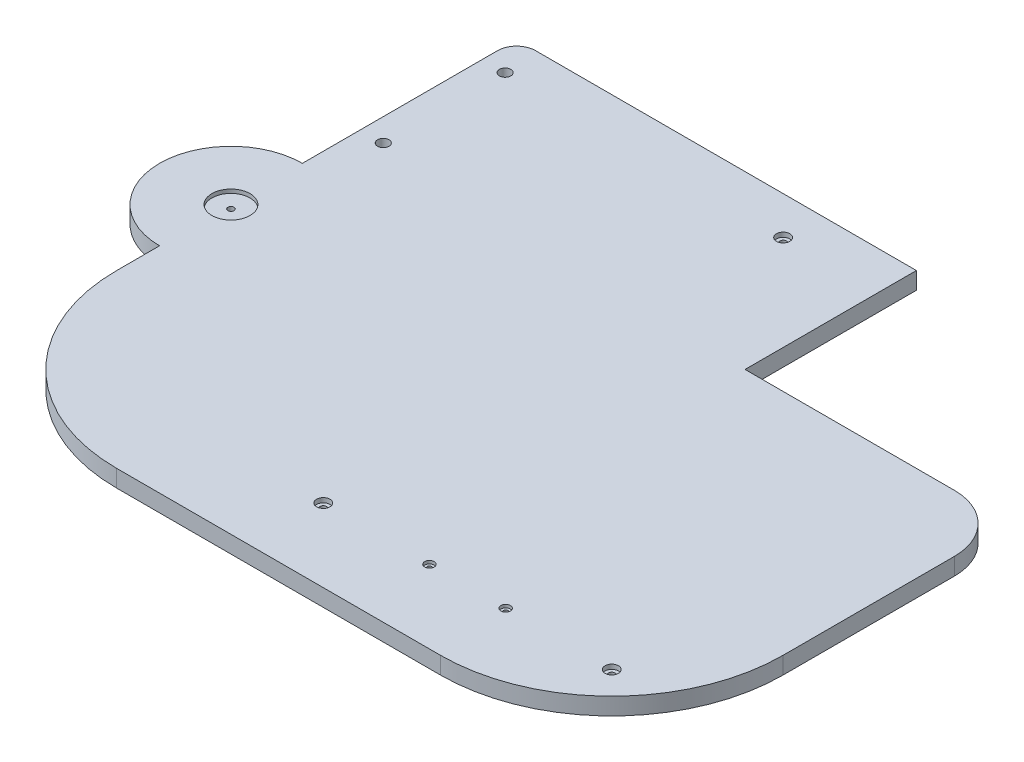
ISO-10303-21;
HEADER;
FILE_DESCRIPTION(('STEP AP214'),'2;1');
FILE_NAME('part.step','',(''),(''),'','','');
FILE_SCHEMA(('AUTOMOTIVE_DESIGN { 1 0 10303 214 1 1 1 1 }'));
ENDSEC;
DATA;
#1=APPLICATION_CONTEXT('core data for automotive mechanical design processes');
#2=APPLICATION_PROTOCOL_DEFINITION('international standard','automotive_design',2000,#1);
#3=PRODUCT_CONTEXT('',#1,'mechanical');
#4=PRODUCT('Part','Part','',(#3));
#5=PRODUCT_RELATED_PRODUCT_CATEGORY('part','',(#4));
#6=PRODUCT_DEFINITION_FORMATION('','',#4);
#7=PRODUCT_DEFINITION_CONTEXT('part definition',#1,'design');
#8=PRODUCT_DEFINITION('design','',#6,#7);
#9=PRODUCT_DEFINITION_SHAPE('','',#8);
#10=(LENGTH_UNIT() NAMED_UNIT(*) SI_UNIT(.MILLI.,.METRE.));
#11=(NAMED_UNIT(*) PLANE_ANGLE_UNIT() SI_UNIT($,.RADIAN.));
#12=(NAMED_UNIT(*) SI_UNIT($,.STERADIAN.) SOLID_ANGLE_UNIT());
#13=UNCERTAINTY_MEASURE_WITH_UNIT(LENGTH_MEASURE(1.E-05),#10,'distance_accuracy_value','');
#14=(GEOMETRIC_REPRESENTATION_CONTEXT(3) GLOBAL_UNCERTAINTY_ASSIGNED_CONTEXT((#13)) GLOBAL_UNIT_ASSIGNED_CONTEXT((#10,
#11,#12)) REPRESENTATION_CONTEXT('',''));
#15=CARTESIAN_POINT('',(0.,0.,0.));
#16=DIRECTION('',(0.,0.,1.));
#17=DIRECTION('',(1.,0.,0.));
#18=AXIS2_PLACEMENT_3D('',#15,#16,#17);
#19=CARTESIAN_POINT('',(37.5000000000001,229.,-1.30930550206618E-13));
#20=DIRECTION('',(0.,-1.,0.));
#21=DIRECTION('',(0.,0.,1.));
#22=AXIS2_PLACEMENT_3D('',#19,#20,#21);
#23=PLANE('',#22);
#24=CARTESIAN_POINT('',(118.250000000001,229.,111.499999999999));
#25=DIRECTION('',(0.,1.,0.));
#26=DIRECTION('',(0.,0.,-1.));
#27=AXIS2_PLACEMENT_3D('',#24,#25,#26);
#28=CIRCLE('',#27,2.5);
#29=CARTESIAN_POINT('',(118.250000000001,229.,108.999999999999));
#30=VERTEX_POINT('',#29);
#31=EDGE_CURVE('E660',#30,#30,#28,.T.);
#32=ORIENTED_EDGE('',*,*,#31,.F.);
#33=EDGE_LOOP('',(#32));
#34=FACE_BOUND('',#33,.T.);
#35=CARTESIAN_POINT('',(-137.5,229.,1.09108791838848E-12));
#36=DIRECTION('',(0.,1.,0.));
#37=DIRECTION('',(0.,0.,-1.));
#38=AXIS2_PLACEMENT_3D('',#35,#36,#37);
#39=CIRCLE('',#38,10.);
#40=CARTESIAN_POINT('',(-137.5,229.,-9.99999999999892));
#41=VERTEX_POINT('',#40);
#42=EDGE_CURVE('E257',#41,#41,#39,.T.);
#43=ORIENTED_EDGE('',*,*,#42,.F.);
#44=EDGE_LOOP('',(#43));
#45=FACE_BOUND('',#44,.T.);
#46=CARTESIAN_POINT('',(174.000000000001,229.,111.499999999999));
#47=DIRECTION('',(0.,1.,0.));
#48=DIRECTION('',(0.,0.,-1.));
#49=AXIS2_PLACEMENT_3D('',#46,#47,#48);
#50=CIRCLE('',#49,3.5);
#51=CARTESIAN_POINT('',(174.000000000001,229.,107.999999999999));
#52=VERTEX_POINT('',#51);
#53=EDGE_CURVE('E261',#52,#52,#50,.T.);
#54=ORIENTED_EDGE('',*,*,#53,.F.);
#55=EDGE_LOOP('',(#54));
#56=FACE_BOUND('',#55,.T.);
#57=CARTESIAN_POINT('',(22.5000000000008,229.,111.5));
#58=DIRECTION('',(0.,1.,0.));
#59=DIRECTION('',(0.,0.,-1.));
#60=AXIS2_PLACEMENT_3D('',#57,#58,#59);
#61=CIRCLE('',#60,3.5);
#62=CARTESIAN_POINT('',(22.5000000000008,229.,108.));
#63=VERTEX_POINT('',#62);
#64=EDGE_CURVE('E235',#63,#63,#61,.T.);
#65=ORIENTED_EDGE('',*,*,#64,.F.);
#66=EDGE_LOOP('',(#65));
#67=FACE_BOUND('',#66,.T.);
#68=CARTESIAN_POINT('',(22.4999999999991,229.,-130.));
#69=DIRECTION('',(0.,1.,0.));
#70=DIRECTION('',(0.,0.,-1.));
#71=AXIS2_PLACEMENT_3D('',#68,#69,#70);
#72=CIRCLE('',#71,3.5);
#73=CARTESIAN_POINT('',(22.4999999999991,229.,-133.5));
#74=VERTEX_POINT('',#73);
#75=EDGE_CURVE('E230',#74,#74,#72,.T.);
#76=ORIENTED_EDGE('',*,*,#75,.F.);
#77=EDGE_LOOP('',(#76));
#78=FACE_BOUND('',#77,.T.);
#79=CARTESIAN_POINT('',(-125.5,229.,-68.0000000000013));
#80=DIRECTION('',(0.,-1.,0.));
#81=DIRECTION('',(0.,0.,1.));
#82=AXIS2_PLACEMENT_3D('',#79,#80,#81);
#83=CIRCLE('',#82,2.99999999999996);
#84=CARTESIAN_POINT('',(-125.5,229.,-65.0000000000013));
#85=VERTEX_POINT('',#84);
#86=EDGE_CURVE('E156',#85,#85,#83,.T.);
#87=ORIENTED_EDGE('',*,*,#86,.T.);
#88=EDGE_LOOP('',(#87));
#89=FACE_BOUND('',#88,.T.);
#90=CARTESIAN_POINT('',(-125.500000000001,229.,-132.000000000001));
#91=DIRECTION('',(0.,-1.,0.));
#92=DIRECTION('',(0.,0.,1.));
#93=AXIS2_PLACEMENT_3D('',#90,#91,#92);
#94=CIRCLE('',#93,2.99999999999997);
#95=CARTESIAN_POINT('',(-125.500000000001,229.,-129.000000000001));
#96=VERTEX_POINT('',#95);
#97=EDGE_CURVE('E163',#96,#96,#94,.T.);
#98=ORIENTED_EDGE('',*,*,#97,.T.);
#99=EDGE_LOOP('',(#98));
#100=FACE_BOUND('',#99,.T.);
#101=DIRECTION('',(0.,0.,-1.));
#102=VECTOR('',#101,1.);
#103=CARTESIAN_POINT('',(212.5,229.,-1.35294901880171E-12));
#104=LINE('',#103,#102);
#105=CARTESIAN_POINT('',(212.5,229.,59.9999999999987));
#106=VERTEX_POINT('',#105);
#107=CARTESIAN_POINT('',(212.5,229.,-30.0000000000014));
#108=VERTEX_POINT('',#107);
#109=EDGE_CURVE('E174',#106,#108,#104,.T.);
#110=ORIENTED_EDGE('',*,*,#109,.T.);
#111=CARTESIAN_POINT('',(182.5,229.,-30.0000000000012));
#112=DIRECTION('',(0.,-1.,0.));
#113=DIRECTION('',(0.,0.,1.));
#114=AXIS2_PLACEMENT_3D('',#111,#112,#113);
#115=CIRCLE('',#114,30.);
#116=CARTESIAN_POINT('',(182.5,229.,-60.0000000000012));
#117=VERTEX_POINT('',#116);
#118=EDGE_CURVE('E56',#108,#117,#115,.F.);
#119=ORIENTED_EDGE('',*,*,#118,.T.);
#120=DIRECTION('',(1.,0.,0.));
#121=VECTOR('',#120,1.);
#122=CARTESIAN_POINT('',(172.5,229.,-60.0000000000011));
#123=LINE('',#122,#121);
#124=CARTESIAN_POINT('',(72.4999999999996,229.,-60.0000000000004));
#125=VERTEX_POINT('',#124);
#126=EDGE_CURVE('E123',#125,#117,#123,.T.);
#127=ORIENTED_EDGE('',*,*,#126,.F.);
#128=DIRECTION('',(0.,0.,1.));
#129=VECTOR('',#128,1.);
#130=CARTESIAN_POINT('',(72.4999999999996,229.,-60.0000000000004));
#131=LINE('',#130,#129);
#132=CARTESIAN_POINT('',(72.4999999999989,229.,-150.));
#133=VERTEX_POINT('',#132);
#134=EDGE_CURVE('E131',#133,#125,#131,.T.);
#135=ORIENTED_EDGE('',*,*,#134,.F.);
#136=DIRECTION('',(-1.,0.,0.));
#137=VECTOR('',#136,1.);
#138=CARTESIAN_POINT('',(212.499999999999,229.,-150.000000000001));
#139=LINE('',#138,#137);
#140=CARTESIAN_POINT('',(-127.500000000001,229.,-149.999999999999));
#141=VERTEX_POINT('',#140);
#142=EDGE_CURVE('E175',#133,#141,#139,.T.);
#143=ORIENTED_EDGE('',*,*,#142,.T.);
#144=CARTESIAN_POINT('',(-127.500000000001,229.,-139.999999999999));
#145=DIRECTION('',(0.,-1.,0.));
#146=DIRECTION('',(0.,0.,1.));
#147=AXIS2_PLACEMENT_3D('',#144,#145,#146);
#148=CIRCLE('',#147,10.);
#149=CARTESIAN_POINT('',(-137.500000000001,229.,-139.999999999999));
#150=VERTEX_POINT('',#149);
#151=EDGE_CURVE('E203',#141,#150,#148,.F.);
#152=ORIENTED_EDGE('',*,*,#151,.T.);
#153=DIRECTION('',(0.,0.,1.));
#154=VECTOR('',#153,1.);
#155=CARTESIAN_POINT('',(-137.500000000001,229.,-149.999999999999));
#156=LINE('',#155,#154);
#157=CARTESIAN_POINT('',(-137.5,229.,-37.4999999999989));
#158=VERTEX_POINT('',#157);
#159=EDGE_CURVE('E168',#150,#158,#156,.T.);
#160=ORIENTED_EDGE('',*,*,#159,.T.);
#161=CARTESIAN_POINT('',(-137.5,229.,1.09108791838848E-12));
#162=DIRECTION('',(0.,1.,0.));
#163=DIRECTION('',(0.,0.,-1.));
#164=AXIS2_PLACEMENT_3D('',#161,#162,#163);
#165=CIRCLE('',#164,37.5);
#166=CARTESIAN_POINT('',(-137.5,229.,37.5000000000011));
#167=VERTEX_POINT('',#166);
#168=EDGE_CURVE('E127',#158,#167,#165,.T.);
#169=ORIENTED_EDGE('',*,*,#168,.T.);
#170=CARTESIAN_POINT('',(-137.5,229.,60.0000000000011));
#171=VERTEX_POINT('',#170);
#172=EDGE_CURVE('E171',#167,#171,#156,.T.);
#173=ORIENTED_EDGE('',*,*,#172,.T.);
#174=CARTESIAN_POINT('',(-47.4999999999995,229.,60.0000000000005));
#175=DIRECTION('',(0.,-1.,0.));
#176=DIRECTION('',(0.,0.,1.));
#177=AXIS2_PLACEMENT_3D('',#174,#175,#176);
#178=CIRCLE('',#177,90.);
#179=CARTESIAN_POINT('',(-47.4999999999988,229.,150.));
#180=VERTEX_POINT('',#179);
#181=EDGE_CURVE('E192',#171,#180,#178,.F.);
#182=ORIENTED_EDGE('',*,*,#181,.T.);
#183=DIRECTION('',(1.,0.,0.));
#184=VECTOR('',#183,1.);
#185=CARTESIAN_POINT('',(212.500000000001,229.,149.999999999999));
#186=LINE('',#185,#184);
#187=CARTESIAN_POINT('',(122.500000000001,229.,149.999999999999));
#188=VERTEX_POINT('',#187);
#189=EDGE_CURVE('E170',#180,#188,#186,.T.);
#190=ORIENTED_EDGE('',*,*,#189,.T.);
#191=CARTESIAN_POINT('',(122.5,229.,59.9999999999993));
#192=DIRECTION('',(0.,-1.,0.));
#193=DIRECTION('',(0.,0.,1.));
#194=AXIS2_PLACEMENT_3D('',#191,#192,#193);
#195=CIRCLE('',#194,90.);
#196=EDGE_CURVE('E218',#188,#106,#195,.F.);
#197=ORIENTED_EDGE('',*,*,#196,.T.);
#198=EDGE_LOOP('',(#110,#119,#127,#135,#143,#152,#160,#169,#173,#182,#190,#197));
#199=FACE_BOUND('',#198,.T.);
#200=CARTESIAN_POINT('',(78.2500000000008,229.,111.5));
#201=DIRECTION('',(0.,1.,0.));
#202=DIRECTION('',(0.,0.,-1.));
#203=AXIS2_PLACEMENT_3D('',#200,#201,#202);
#204=CIRCLE('',#203,2.5);
#205=CARTESIAN_POINT('',(78.2500000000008,229.,109.));
#206=VERTEX_POINT('',#205);
#207=EDGE_CURVE('E251',#206,#206,#204,.T.);
#208=ORIENTED_EDGE('',*,*,#207,.F.);
#209=EDGE_LOOP('',(#208));
#210=FACE_BOUND('',#209,.T.);
#211=ADVANCED_FACE('F32',(#34,#45,#56,#67,#78,#89,#100,#199,#210),#23,.F.);
#212=CARTESIAN_POINT('',(212.499999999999,229.,-150.000000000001));
#213=DIRECTION('',(0.,0.,1.));
#214=DIRECTION('',(1.,0.,0.));
#215=AXIS2_PLACEMENT_3D('',#212,#213,#214);
#216=PLANE('',#215);
#217=ORIENTED_EDGE('',*,*,#142,.F.);
#218=DIRECTION('',(0.,1.,0.));
#219=VECTOR('',#218,1.);
#220=CARTESIAN_POINT('',(72.4999999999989,-125.536240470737,-150.));
#221=LINE('',#220,#219);
#222=CARTESIAN_POINT('',(72.4999999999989,220.,-150.));
#223=VERTEX_POINT('',#222);
#224=EDGE_CURVE('E128',#223,#133,#221,.T.);
#225=ORIENTED_EDGE('',*,*,#224,.F.);
#226=DIRECTION('',(-1.,0.,0.));
#227=VECTOR('',#226,1.);
#228=CARTESIAN_POINT('',(212.499999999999,220.,-150.000000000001));
#229=LINE('',#228,#227);
#230=CARTESIAN_POINT('',(-127.500000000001,220.,-149.999999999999));
#231=VERTEX_POINT('',#230);
#232=EDGE_CURVE('E184',#223,#231,#229,.T.);
#233=ORIENTED_EDGE('',*,*,#232,.T.);
#234=DIRECTION('',(0.,-1.,0.));
#235=VECTOR('',#234,1.);
#236=CARTESIAN_POINT('',(-127.500000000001,229.,-149.999999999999));
#237=LINE('',#236,#235);
#238=EDGE_CURVE('E200',#231,#141,#237,.F.);
#239=ORIENTED_EDGE('',*,*,#238,.T.);
#240=EDGE_LOOP('',(#217,#225,#233,#239));
#241=FACE_BOUND('',#240,.T.);
#242=ADVANCED_FACE('F302',(#241),#216,.F.);
#243=CARTESIAN_POINT('',(-137.500000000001,229.,-149.999999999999));
#244=DIRECTION('',(1.,0.,0.));
#245=DIRECTION('',(0.,0.,-1.));
#246=AXIS2_PLACEMENT_3D('',#243,#244,#245);
#247=PLANE('',#246);
#248=ORIENTED_EDGE('',*,*,#159,.F.);
#249=DIRECTION('',(0.,-1.,0.));
#250=VECTOR('',#249,1.);
#251=CARTESIAN_POINT('',(-137.500000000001,229.,-139.999999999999));
#252=LINE('',#251,#250);
#253=CARTESIAN_POINT('',(-137.500000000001,220.,-139.999999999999));
#254=VERTEX_POINT('',#253);
#255=EDGE_CURVE('E194',#150,#254,#252,.T.);
#256=ORIENTED_EDGE('',*,*,#255,.T.);
#257=DIRECTION('',(0.,0.,1.));
#258=VECTOR('',#257,1.);
#259=CARTESIAN_POINT('',(-137.500000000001,220.,-149.999999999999));
#260=LINE('',#259,#258);
#261=CARTESIAN_POINT('',(-137.5,220.,-37.4999999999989));
#262=VERTEX_POINT('',#261);
#263=EDGE_CURVE('E178',#254,#262,#260,.T.);
#264=ORIENTED_EDGE('',*,*,#263,.T.);
#265=DIRECTION('',(0.,1.,0.));
#266=VECTOR('',#265,1.);
#267=CARTESIAN_POINT('',(-137.5,220.,-37.4999999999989));
#268=LINE('',#267,#266);
#269=EDGE_CURVE('E150',#262,#158,#268,.T.);
#270=ORIENTED_EDGE('',*,*,#269,.T.);
#271=EDGE_LOOP('',(#248,#256,#264,#270));
#272=FACE_BOUND('',#271,.T.);
#273=ADVANCED_FACE('F308',(#272),#247,.F.);
#274=CARTESIAN_POINT('',(-137.5,220.,37.5000000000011));
#275=VERTEX_POINT('',#274);
#276=CARTESIAN_POINT('',(-137.5,220.,60.0000000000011));
#277=VERTEX_POINT('',#276);
#278=EDGE_CURVE('E159',#275,#277,#260,.T.);
#279=ORIENTED_EDGE('',*,*,#278,.T.);
#280=DIRECTION('',(0.,-1.,0.));
#281=VECTOR('',#280,1.);
#282=CARTESIAN_POINT('',(-137.5,229.,60.0000000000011));
#283=LINE('',#282,#281);
#284=EDGE_CURVE('E190',#277,#171,#283,.F.);
#285=ORIENTED_EDGE('',*,*,#284,.T.);
#286=ORIENTED_EDGE('',*,*,#172,.F.);
#287=DIRECTION('',(0.,1.,0.));
#288=VECTOR('',#287,1.);
#289=CARTESIAN_POINT('',(-137.5,220.,37.5000000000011));
#290=LINE('',#289,#288);
#291=EDGE_CURVE('E147',#275,#167,#290,.T.);
#292=ORIENTED_EDGE('',*,*,#291,.F.);
#293=EDGE_LOOP('',(#279,#285,#286,#292));
#294=FACE_BOUND('',#293,.T.);
#295=ADVANCED_FACE('F325',(#294),#247,.F.);
#296=CARTESIAN_POINT('',(212.500000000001,229.,149.999999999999));
#297=DIRECTION('',(0.,0.,-1.));
#298=DIRECTION('',(-1.,0.,0.));
#299=AXIS2_PLACEMENT_3D('',#296,#297,#298);
#300=PLANE('',#299);
#301=DIRECTION('',(1.,0.,0.));
#302=VECTOR('',#301,1.);
#303=CARTESIAN_POINT('',(212.500000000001,220.,149.999999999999));
#304=LINE('',#303,#302);
#305=CARTESIAN_POINT('',(-47.4999999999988,220.,150.));
#306=VERTEX_POINT('',#305);
#307=CARTESIAN_POINT('',(122.500000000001,220.,149.999999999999));
#308=VERTEX_POINT('',#307);
#309=EDGE_CURVE('E180',#306,#308,#304,.T.);
#310=ORIENTED_EDGE('',*,*,#309,.T.);
#311=DIRECTION('',(0.,-1.,0.));
#312=VECTOR('',#311,1.);
#313=CARTESIAN_POINT('',(122.500000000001,229.,149.999999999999));
#314=LINE('',#313,#312);
#315=EDGE_CURVE('E216',#308,#188,#314,.F.);
#316=ORIENTED_EDGE('',*,*,#315,.T.);
#317=ORIENTED_EDGE('',*,*,#189,.F.);
#318=DIRECTION('',(0.,-1.,0.));
#319=VECTOR('',#318,1.);
#320=CARTESIAN_POINT('',(-47.4999999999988,229.,150.));
#321=LINE('',#320,#319);
#322=EDGE_CURVE('E177',#180,#306,#321,.T.);
#323=ORIENTED_EDGE('',*,*,#322,.T.);
#324=EDGE_LOOP('',(#310,#316,#317,#323));
#325=FACE_BOUND('',#324,.T.);
#326=ADVANCED_FACE('F322',(#325),#300,.F.);
#327=CARTESIAN_POINT('',(212.499999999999,229.,-150.000000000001));
#328=DIRECTION('',(-1.,0.,0.));
#329=DIRECTION('',(0.,0.,1.));
#330=AXIS2_PLACEMENT_3D('',#327,#328,#329);
#331=PLANE('',#330);
#332=DIRECTION('',(0.,0.,-1.));
#333=VECTOR('',#332,1.);
#334=CARTESIAN_POINT('',(212.5,220.,-1.35294901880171E-12));
#335=LINE('',#334,#333);
#336=CARTESIAN_POINT('',(212.5,220.,59.9999999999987));
#337=VERTEX_POINT('',#336);
#338=CARTESIAN_POINT('',(212.5,220.,-30.0000000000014));
#339=VERTEX_POINT('',#338);
#340=EDGE_CURVE('E183',#337,#339,#335,.T.);
#341=ORIENTED_EDGE('',*,*,#340,.T.);
#342=DIRECTION('',(0.,1.,0.));
#343=VECTOR('',#342,1.);
#344=CARTESIAN_POINT('',(212.5,229.,-30.0000000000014));
#345=LINE('',#344,#343);
#346=EDGE_CURVE('E220',#339,#108,#345,.T.);
#347=ORIENTED_EDGE('',*,*,#346,.T.);
#348=ORIENTED_EDGE('',*,*,#109,.F.);
#349=DIRECTION('',(0.,-1.,0.));
#350=VECTOR('',#349,1.);
#351=CARTESIAN_POINT('',(212.5,229.,59.9999999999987));
#352=LINE('',#351,#350);
#353=EDGE_CURVE('E208',#106,#337,#352,.T.);
#354=ORIENTED_EDGE('',*,*,#353,.T.);
#355=EDGE_LOOP('',(#341,#347,#348,#354));
#356=FACE_BOUND('',#355,.T.);
#357=ADVANCED_FACE('F319',(#356),#331,.F.);
#358=CARTESIAN_POINT('',(37.5000000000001,220.,-1.30930550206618E-13));
#359=DIRECTION('',(0.,-1.,0.));
#360=DIRECTION('',(0.,0.,1.));
#361=AXIS2_PLACEMENT_3D('',#358,#359,#360);
#362=PLANE('',#361);
#363=CARTESIAN_POINT('',(118.250000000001,220.,111.499999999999));
#364=DIRECTION('',(0.,-1.,0.));
#365=DIRECTION('',(0.,0.,1.));
#366=AXIS2_PLACEMENT_3D('',#363,#364,#365);
#367=CIRCLE('',#366,1.19999999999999);
#368=CARTESIAN_POINT('',(118.250000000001,220.,112.699999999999));
#369=VERTEX_POINT('',#368);
#370=EDGE_CURVE('E36',#369,#369,#367,.T.);
#371=ORIENTED_EDGE('',*,*,#370,.F.);
#372=EDGE_LOOP('',(#371));
#373=FACE_BOUND('',#372,.T.);
#374=CARTESIAN_POINT('',(78.2500000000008,220.,111.5));
#375=DIRECTION('',(0.,-1.,0.));
#376=DIRECTION('',(0.,0.,1.));
#377=AXIS2_PLACEMENT_3D('',#374,#375,#376);
#378=CIRCLE('',#377,1.2);
#379=CARTESIAN_POINT('',(78.2500000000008,220.,112.7));
#380=VERTEX_POINT('',#379);
#381=EDGE_CURVE('E240',#380,#380,#378,.T.);
#382=ORIENTED_EDGE('',*,*,#381,.F.);
#383=EDGE_LOOP('',(#382));
#384=FACE_BOUND('',#383,.T.);
#385=CARTESIAN_POINT('',(-137.5,220.,1.09108791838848E-12));
#386=DIRECTION('',(0.,-1.,0.));
#387=DIRECTION('',(0.,0.,1.));
#388=AXIS2_PLACEMENT_3D('',#385,#386,#387);
#389=CIRCLE('',#388,1.59999999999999);
#390=CARTESIAN_POINT('',(-137.5,220.,1.60000000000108));
#391=VERTEX_POINT('',#390);
#392=EDGE_CURVE('E237',#391,#391,#389,.T.);
#393=ORIENTED_EDGE('',*,*,#392,.F.);
#394=EDGE_LOOP('',(#393));
#395=FACE_BOUND('',#394,.T.);
#396=CARTESIAN_POINT('',(174.000000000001,220.,111.499999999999));
#397=DIRECTION('',(0.,-1.,0.));
#398=DIRECTION('',(0.,0.,1.));
#399=AXIS2_PLACEMENT_3D('',#396,#397,#398);
#400=CIRCLE('',#399,1.70000000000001);
#401=CARTESIAN_POINT('',(174.000000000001,220.,113.199999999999));
#402=VERTEX_POINT('',#401);
#403=EDGE_CURVE('E232',#402,#402,#400,.T.);
#404=ORIENTED_EDGE('',*,*,#403,.F.);
#405=EDGE_LOOP('',(#404));
#406=FACE_BOUND('',#405,.T.);
#407=CARTESIAN_POINT('',(22.5000000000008,220.,111.5));
#408=DIRECTION('',(0.,-1.,0.));
#409=DIRECTION('',(0.,0.,1.));
#410=AXIS2_PLACEMENT_3D('',#407,#408,#409);
#411=CIRCLE('',#410,1.7);
#412=CARTESIAN_POINT('',(22.5000000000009,220.,113.2));
#413=VERTEX_POINT('',#412);
#414=EDGE_CURVE('E227',#413,#413,#411,.T.);
#415=ORIENTED_EDGE('',*,*,#414,.F.);
#416=EDGE_LOOP('',(#415));
#417=FACE_BOUND('',#416,.T.);
#418=CARTESIAN_POINT('',(22.4999999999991,220.,-130.));
#419=DIRECTION('',(0.,-1.,0.));
#420=DIRECTION('',(0.,0.,1.));
#421=AXIS2_PLACEMENT_3D('',#418,#419,#420);
#422=CIRCLE('',#421,1.7);
#423=CARTESIAN_POINT('',(22.4999999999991,220.,-128.3));
#424=VERTEX_POINT('',#423);
#425=EDGE_CURVE('E135',#424,#424,#422,.T.);
#426=ORIENTED_EDGE('',*,*,#425,.F.);
#427=EDGE_LOOP('',(#426));
#428=FACE_BOUND('',#427,.T.);
#429=DIRECTION('',(-1.,0.,0.));
#430=VECTOR('',#429,1.);
#431=CARTESIAN_POINT('',(37.4999999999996,220.,-60.0000000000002));
#432=LINE('',#431,#430);
#433=CARTESIAN_POINT('',(182.5,220.,-60.0000000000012));
#434=VERTEX_POINT('',#433);
#435=CARTESIAN_POINT('',(72.4999999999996,220.,-60.0000000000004));
#436=VERTEX_POINT('',#435);
#437=EDGE_CURVE('E124',#434,#436,#432,.T.);
#438=ORIENTED_EDGE('',*,*,#437,.F.);
#439=CARTESIAN_POINT('',(182.5,220.,-30.0000000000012));
#440=DIRECTION('',(0.,-1.,0.));
#441=DIRECTION('',(0.,0.,1.));
#442=AXIS2_PLACEMENT_3D('',#439,#440,#441);
#443=CIRCLE('',#442,30.);
#444=EDGE_CURVE('E11',#434,#339,#443,.T.);
#445=ORIENTED_EDGE('',*,*,#444,.T.);
#446=ORIENTED_EDGE('',*,*,#340,.F.);
#447=CARTESIAN_POINT('',(122.5,220.,59.9999999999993));
#448=DIRECTION('',(0.,-1.,0.));
#449=DIRECTION('',(0.,0.,1.));
#450=AXIS2_PLACEMENT_3D('',#447,#448,#449);
#451=CIRCLE('',#450,90.);
#452=EDGE_CURVE('E214',#337,#308,#451,.T.);
#453=ORIENTED_EDGE('',*,*,#452,.T.);
#454=ORIENTED_EDGE('',*,*,#309,.F.);
#455=CARTESIAN_POINT('',(-47.4999999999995,220.,60.0000000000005));
#456=DIRECTION('',(0.,-1.,0.));
#457=DIRECTION('',(0.,0.,1.));
#458=AXIS2_PLACEMENT_3D('',#455,#456,#457);
#459=CIRCLE('',#458,90.);
#460=EDGE_CURVE('E188',#306,#277,#459,.T.);
#461=ORIENTED_EDGE('',*,*,#460,.T.);
#462=ORIENTED_EDGE('',*,*,#278,.F.);
#463=CARTESIAN_POINT('',(-137.5,220.,1.09108791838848E-12));
#464=DIRECTION('',(0.,1.,0.));
#465=DIRECTION('',(0.,0.,-1.));
#466=AXIS2_PLACEMENT_3D('',#463,#464,#465);
#467=CIRCLE('',#466,37.5);
#468=EDGE_CURVE('E144',#262,#275,#467,.T.);
#469=ORIENTED_EDGE('',*,*,#468,.F.);
#470=ORIENTED_EDGE('',*,*,#263,.F.);
#471=CARTESIAN_POINT('',(-127.500000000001,220.,-139.999999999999));
#472=DIRECTION('',(0.,-1.,0.));
#473=DIRECTION('',(0.,0.,1.));
#474=AXIS2_PLACEMENT_3D('',#471,#472,#473);
#475=CIRCLE('',#474,10.);
#476=EDGE_CURVE('E197',#254,#231,#475,.T.);
#477=ORIENTED_EDGE('',*,*,#476,.T.);
#478=ORIENTED_EDGE('',*,*,#232,.F.);
#479=DIRECTION('',(0.,0.,-1.));
#480=VECTOR('',#479,1.);
#481=CARTESIAN_POINT('',(72.5,220.,-3.80731161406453E-13));
#482=LINE('',#481,#480);
#483=EDGE_CURVE('E206',#436,#223,#482,.T.);
#484=ORIENTED_EDGE('',*,*,#483,.F.);
#485=EDGE_LOOP('',(#438,#445,#446,#453,#454,#461,#462,#469,#470,#477,#478,#484));
#486=FACE_BOUND('',#485,.T.);
#487=CARTESIAN_POINT('',(-125.5,220.,-68.0000000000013));
#488=DIRECTION('',(0.,-1.,0.));
#489=DIRECTION('',(0.,0.,1.));
#490=AXIS2_PLACEMENT_3D('',#487,#488,#489);
#491=CIRCLE('',#490,2.99999999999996);
#492=CARTESIAN_POINT('',(-125.5,220.,-65.0000000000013));
#493=VERTEX_POINT('',#492);
#494=EDGE_CURVE('E160',#493,#493,#491,.T.);
#495=ORIENTED_EDGE('',*,*,#494,.F.);
#496=EDGE_LOOP('',(#495));
#497=FACE_BOUND('',#496,.T.);
#498=CARTESIAN_POINT('',(-125.500000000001,220.,-132.000000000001));
#499=DIRECTION('',(0.,-1.,0.));
#500=DIRECTION('',(0.,0.,1.));
#501=AXIS2_PLACEMENT_3D('',#498,#499,#500);
#502=CIRCLE('',#501,2.99999999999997);
#503=CARTESIAN_POINT('',(-125.500000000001,220.,-129.000000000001));
#504=VERTEX_POINT('',#503);
#505=EDGE_CURVE('E153',#504,#504,#502,.T.);
#506=ORIENTED_EDGE('',*,*,#505,.F.);
#507=EDGE_LOOP('',(#506));
#508=FACE_BOUND('',#507,.T.);
#509=ADVANCED_FACE('F317',(#373,#384,#395,#406,#417,#428,#486,#497,#508),#362,.T.);
#510=CARTESIAN_POINT('',(-125.500000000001,229.,-132.000000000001));
#511=DIRECTION('',(0.,-1.,0.));
#512=DIRECTION('',(0.,0.,1.));
#513=AXIS2_PLACEMENT_3D('',#510,#511,#512);
#514=CYLINDRICAL_SURFACE('',#513,2.99999999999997);
#515=ORIENTED_EDGE('',*,*,#97,.F.);
#516=EDGE_LOOP('',(#515));
#517=FACE_BOUND('',#516,.T.);
#518=ORIENTED_EDGE('',*,*,#505,.T.);
#519=EDGE_LOOP('',(#518));
#520=FACE_BOUND('',#519,.T.);
#521=ADVANCED_FACE('F315',(#517,#520),#514,.F.);
#522=CARTESIAN_POINT('',(-125.5,229.,-68.0000000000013));
#523=DIRECTION('',(0.,-1.,0.));
#524=DIRECTION('',(0.,0.,1.));
#525=AXIS2_PLACEMENT_3D('',#522,#523,#524);
#526=CYLINDRICAL_SURFACE('',#525,2.99999999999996);
#527=ORIENTED_EDGE('',*,*,#86,.F.);
#528=EDGE_LOOP('',(#527));
#529=FACE_BOUND('',#528,.T.);
#530=ORIENTED_EDGE('',*,*,#494,.T.);
#531=EDGE_LOOP('',(#530));
#532=FACE_BOUND('',#531,.T.);
#533=ADVANCED_FACE('F379',(#529,#532),#526,.F.);
#534=CARTESIAN_POINT('',(-137.5,220.,1.09108791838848E-12));
#535=DIRECTION('',(0.,1.,0.));
#536=DIRECTION('',(0.,0.,-1.));
#537=AXIS2_PLACEMENT_3D('',#534,#535,#536);
#538=CYLINDRICAL_SURFACE('',#537,37.5);
#539=ORIENTED_EDGE('',*,*,#168,.F.);
#540=ORIENTED_EDGE('',*,*,#269,.F.);
#541=ORIENTED_EDGE('',*,*,#468,.T.);
#542=ORIENTED_EDGE('',*,*,#291,.T.);
#543=EDGE_LOOP('',(#539,#540,#541,#542));
#544=FACE_BOUND('',#543,.T.);
#545=ADVANCED_FACE('F334',(#544),#538,.T.);
#546=CARTESIAN_POINT('',(-47.4999999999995,229.,60.0000000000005));
#547=DIRECTION('',(0.,-1.,0.));
#548=DIRECTION('',(0.,0.,1.));
#549=AXIS2_PLACEMENT_3D('',#546,#547,#548);
#550=CYLINDRICAL_SURFACE('',#549,90.);
#551=ORIENTED_EDGE('',*,*,#181,.F.);
#552=ORIENTED_EDGE('',*,*,#284,.F.);
#553=ORIENTED_EDGE('',*,*,#460,.F.);
#554=ORIENTED_EDGE('',*,*,#322,.F.);
#555=EDGE_LOOP('',(#551,#552,#553,#554));
#556=FACE_BOUND('',#555,.T.);
#557=ADVANCED_FACE('F330',(#556),#550,.T.);
#558=CARTESIAN_POINT('',(-127.500000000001,229.,-139.999999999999));
#559=DIRECTION('',(0.,-1.,0.));
#560=DIRECTION('',(0.,0.,1.));
#561=AXIS2_PLACEMENT_3D('',#558,#559,#560);
#562=CYLINDRICAL_SURFACE('',#561,10.);
#563=ORIENTED_EDGE('',*,*,#151,.F.);
#564=ORIENTED_EDGE('',*,*,#238,.F.);
#565=ORIENTED_EDGE('',*,*,#476,.F.);
#566=ORIENTED_EDGE('',*,*,#255,.F.);
#567=EDGE_LOOP('',(#563,#564,#565,#566));
#568=FACE_BOUND('',#567,.T.);
#569=ADVANCED_FACE('F333',(#568),#562,.T.);
#570=CARTESIAN_POINT('',(72.4999999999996,-125.536240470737,-60.0000000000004));
#571=DIRECTION('',(-1.,0.,0.));
#572=DIRECTION('',(0.,0.,1.));
#573=AXIS2_PLACEMENT_3D('',#570,#571,#572);
#574=PLANE('',#573);
#575=ORIENTED_EDGE('',*,*,#483,.T.);
#576=ORIENTED_EDGE('',*,*,#224,.T.);
#577=ORIENTED_EDGE('',*,*,#134,.T.);
#578=DIRECTION('',(0.,1.,0.));
#579=VECTOR('',#578,1.);
#580=CARTESIAN_POINT('',(72.4999999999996,-125.536240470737,-60.0000000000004));
#581=LINE('',#580,#579);
#582=EDGE_CURVE('E120',#436,#125,#581,.T.);
#583=ORIENTED_EDGE('',*,*,#582,.F.);
#584=EDGE_LOOP('',(#575,#576,#577,#583));
#585=FACE_BOUND('',#584,.T.);
#586=ADVANCED_FACE('F132',(#585),#574,.F.);
#587=CARTESIAN_POINT('',(172.5,-125.536240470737,-60.0000000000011));
#588=DIRECTION('',(0.,0.,1.));
#589=DIRECTION('',(1.,0.,0.));
#590=AXIS2_PLACEMENT_3D('',#587,#588,#589);
#591=PLANE('',#590);
#592=ORIENTED_EDGE('',*,*,#126,.T.);
#593=DIRECTION('',(0.,1.,0.));
#594=VECTOR('',#593,1.);
#595=CARTESIAN_POINT('',(182.5,-125.536240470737,-60.0000000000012));
#596=LINE('',#595,#594);
#597=EDGE_CURVE('E41',#117,#434,#596,.F.);
#598=ORIENTED_EDGE('',*,*,#597,.T.);
#599=ORIENTED_EDGE('',*,*,#437,.T.);
#600=ORIENTED_EDGE('',*,*,#582,.T.);
#601=EDGE_LOOP('',(#592,#598,#599,#600));
#602=FACE_BOUND('',#601,.T.);
#603=ADVANCED_FACE('F122',(#602),#591,.F.);
#604=CARTESIAN_POINT('',(122.5,229.,59.9999999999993));
#605=DIRECTION('',(0.,-1.,0.));
#606=DIRECTION('',(0.,0.,1.));
#607=AXIS2_PLACEMENT_3D('',#604,#605,#606);
#608=CYLINDRICAL_SURFACE('',#607,90.);
#609=ORIENTED_EDGE('',*,*,#196,.F.);
#610=ORIENTED_EDGE('',*,*,#315,.F.);
#611=ORIENTED_EDGE('',*,*,#452,.F.);
#612=ORIENTED_EDGE('',*,*,#353,.F.);
#613=EDGE_LOOP('',(#609,#610,#611,#612));
#614=FACE_BOUND('',#613,.T.);
#615=ADVANCED_FACE('F341',(#614),#608,.T.);
#616=CARTESIAN_POINT('',(182.5,229.,-30.0000000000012));
#617=DIRECTION('',(0.,1.,0.));
#618=DIRECTION('',(0.,0.,-1.));
#619=AXIS2_PLACEMENT_3D('',#616,#617,#618);
#620=CYLINDRICAL_SURFACE('',#619,30.);
#621=ORIENTED_EDGE('',*,*,#444,.F.);
#622=ORIENTED_EDGE('',*,*,#597,.F.);
#623=ORIENTED_EDGE('',*,*,#118,.F.);
#624=ORIENTED_EDGE('',*,*,#346,.F.);
#625=EDGE_LOOP('',(#621,#622,#623,#624));
#626=FACE_BOUND('',#625,.T.);
#627=ADVANCED_FACE('F34',(#626),#620,.T.);
#628=CARTESIAN_POINT('',(22.4999999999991,229.,-130.));
#629=DIRECTION('',(0.,1.,0.));
#630=DIRECTION('',(0.,0.,-1.));
#631=AXIS2_PLACEMENT_3D('',#628,#629,#630);
#632=CYLINDRICAL_SURFACE('',#631,1.7);
#633=ORIENTED_EDGE('',*,*,#425,.T.);
#634=EDGE_LOOP('',(#633));
#635=FACE_BOUND('',#634,.T.);
#636=CARTESIAN_POINT('',(22.4999999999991,226.6,-130.));
#637=DIRECTION('',(0.,1.,0.));
#638=DIRECTION('',(0.,0.,-1.));
#639=AXIS2_PLACEMENT_3D('',#636,#637,#638);
#640=CIRCLE('',#639,1.7);
#641=CARTESIAN_POINT('',(22.4999999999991,226.6,-131.7));
#642=VERTEX_POINT('',#641);
#643=EDGE_CURVE('E141',#642,#642,#640,.T.);
#644=ORIENTED_EDGE('',*,*,#643,.T.);
#645=EDGE_LOOP('',(#644));
#646=FACE_BOUND('',#645,.T.);
#647=ADVANCED_FACE('F286',(#635,#646),#632,.F.);
#648=CARTESIAN_POINT('',(20.7999999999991,226.6,-130.));
#649=DIRECTION('',(0.,-1.,0.));
#650=DIRECTION('',(0.,0.,1.));
#651=AXIS2_PLACEMENT_3D('',#648,#649,#650);
#652=PLANE('',#651);
#653=ORIENTED_EDGE('',*,*,#643,.F.);
#654=EDGE_LOOP('',(#653));
#655=FACE_BOUND('',#654,.T.);
#656=CARTESIAN_POINT('',(22.4999999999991,226.6,-130.));
#657=DIRECTION('',(0.,1.,0.));
#658=DIRECTION('',(0.,0.,-1.));
#659=AXIS2_PLACEMENT_3D('',#656,#657,#658);
#660=CIRCLE('',#659,3.5);
#661=CARTESIAN_POINT('',(22.4999999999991,226.6,-133.5));
#662=VERTEX_POINT('',#661);
#663=EDGE_CURVE('E279',#662,#662,#660,.T.);
#664=ORIENTED_EDGE('',*,*,#663,.T.);
#665=EDGE_LOOP('',(#664));
#666=FACE_BOUND('',#665,.T.);
#667=ADVANCED_FACE('F288',(#655,#666),#652,.F.);
#668=CARTESIAN_POINT('',(22.4999999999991,229.,-130.));
#669=DIRECTION('',(0.,1.,0.));
#670=DIRECTION('',(0.,0.,-1.));
#671=AXIS2_PLACEMENT_3D('',#668,#669,#670);
#672=CYLINDRICAL_SURFACE('',#671,3.5);
#673=ORIENTED_EDGE('',*,*,#663,.F.);
#674=EDGE_LOOP('',(#673));
#675=FACE_BOUND('',#674,.T.);
#676=ORIENTED_EDGE('',*,*,#75,.T.);
#677=EDGE_LOOP('',(#676));
#678=FACE_BOUND('',#677,.T.);
#679=ADVANCED_FACE('F290',(#675,#678),#672,.F.);
#680=CARTESIAN_POINT('',(22.5000000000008,229.,111.5));
#681=DIRECTION('',(0.,1.,0.));
#682=DIRECTION('',(0.,0.,-1.));
#683=AXIS2_PLACEMENT_3D('',#680,#681,#682);
#684=CYLINDRICAL_SURFACE('',#683,1.7);
#685=ORIENTED_EDGE('',*,*,#414,.T.);
#686=EDGE_LOOP('',(#685));
#687=FACE_BOUND('',#686,.T.);
#688=CARTESIAN_POINT('',(22.5000000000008,226.6,111.5));
#689=DIRECTION('',(0.,1.,0.));
#690=DIRECTION('',(0.,0.,-1.));
#691=AXIS2_PLACEMENT_3D('',#688,#689,#690);
#692=CIRCLE('',#691,1.7);
#693=CARTESIAN_POINT('',(22.5000000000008,226.6,109.8));
#694=VERTEX_POINT('',#693);
#695=EDGE_CURVE('E231',#694,#694,#692,.T.);
#696=ORIENTED_EDGE('',*,*,#695,.T.);
#697=EDGE_LOOP('',(#696));
#698=FACE_BOUND('',#697,.T.);
#699=ADVANCED_FACE('F296',(#687,#698),#684,.F.);
#700=CARTESIAN_POINT('',(20.8000000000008,226.6,111.5));
#701=DIRECTION('',(0.,-1.,0.));
#702=DIRECTION('',(0.,0.,1.));
#703=AXIS2_PLACEMENT_3D('',#700,#701,#702);
#704=PLANE('',#703);
#705=ORIENTED_EDGE('',*,*,#695,.F.);
#706=EDGE_LOOP('',(#705));
#707=FACE_BOUND('',#706,.T.);
#708=CARTESIAN_POINT('',(22.5000000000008,226.6,111.5));
#709=DIRECTION('',(0.,1.,0.));
#710=DIRECTION('',(0.,0.,-1.));
#711=AXIS2_PLACEMENT_3D('',#708,#709,#710);
#712=CIRCLE('',#711,3.5);
#713=CARTESIAN_POINT('',(22.5000000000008,226.6,108.));
#714=VERTEX_POINT('',#713);
#715=EDGE_CURVE('E273',#714,#714,#712,.T.);
#716=ORIENTED_EDGE('',*,*,#715,.T.);
#717=EDGE_LOOP('',(#716));
#718=FACE_BOUND('',#717,.T.);
#719=ADVANCED_FACE('F433',(#707,#718),#704,.F.);
#720=CARTESIAN_POINT('',(22.5000000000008,229.,111.5));
#721=DIRECTION('',(0.,1.,0.));
#722=DIRECTION('',(0.,0.,-1.));
#723=AXIS2_PLACEMENT_3D('',#720,#721,#722);
#724=CYLINDRICAL_SURFACE('',#723,3.5);
#725=ORIENTED_EDGE('',*,*,#715,.F.);
#726=EDGE_LOOP('',(#725));
#727=FACE_BOUND('',#726,.T.);
#728=ORIENTED_EDGE('',*,*,#64,.T.);
#729=EDGE_LOOP('',(#728));
#730=FACE_BOUND('',#729,.T.);
#731=ADVANCED_FACE('F443',(#727,#730),#724,.F.);
#732=CARTESIAN_POINT('',(174.000000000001,229.,111.499999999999));
#733=DIRECTION('',(0.,1.,0.));
#734=DIRECTION('',(0.,0.,-1.));
#735=AXIS2_PLACEMENT_3D('',#732,#733,#734);
#736=CYLINDRICAL_SURFACE('',#735,1.70000000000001);
#737=ORIENTED_EDGE('',*,*,#403,.T.);
#738=EDGE_LOOP('',(#737));
#739=FACE_BOUND('',#738,.T.);
#740=CARTESIAN_POINT('',(174.000000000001,226.6,111.499999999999));
#741=DIRECTION('',(0.,1.,0.));
#742=DIRECTION('',(0.,0.,-1.));
#743=AXIS2_PLACEMENT_3D('',#740,#741,#742);
#744=CIRCLE('',#743,1.70000000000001);
#745=CARTESIAN_POINT('',(174.000000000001,226.6,109.799999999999));
#746=VERTEX_POINT('',#745);
#747=EDGE_CURVE('E236',#746,#746,#744,.T.);
#748=ORIENTED_EDGE('',*,*,#747,.T.);
#749=EDGE_LOOP('',(#748));
#750=FACE_BOUND('',#749,.T.);
#751=ADVANCED_FACE('F453',(#739,#750),#736,.F.);
#752=CARTESIAN_POINT('',(172.300000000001,226.6,111.499999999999));
#753=DIRECTION('',(0.,-1.,0.));
#754=DIRECTION('',(0.,0.,1.));
#755=AXIS2_PLACEMENT_3D('',#752,#753,#754);
#756=PLANE('',#755);
#757=ORIENTED_EDGE('',*,*,#747,.F.);
#758=EDGE_LOOP('',(#757));
#759=FACE_BOUND('',#758,.T.);
#760=CARTESIAN_POINT('',(174.000000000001,226.6,111.499999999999));
#761=DIRECTION('',(0.,1.,0.));
#762=DIRECTION('',(0.,0.,-1.));
#763=AXIS2_PLACEMENT_3D('',#760,#761,#762);
#764=CIRCLE('',#763,3.5);
#765=CARTESIAN_POINT('',(174.000000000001,226.6,107.999999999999));
#766=VERTEX_POINT('',#765);
#767=EDGE_CURVE('E266',#766,#766,#764,.T.);
#768=ORIENTED_EDGE('',*,*,#767,.T.);
#769=EDGE_LOOP('',(#768));
#770=FACE_BOUND('',#769,.T.);
#771=ADVANCED_FACE('F463',(#759,#770),#756,.F.);
#772=CARTESIAN_POINT('',(174.000000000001,229.,111.499999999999));
#773=DIRECTION('',(0.,1.,0.));
#774=DIRECTION('',(0.,0.,-1.));
#775=AXIS2_PLACEMENT_3D('',#772,#773,#774);
#776=CYLINDRICAL_SURFACE('',#775,3.5);
#777=ORIENTED_EDGE('',*,*,#767,.F.);
#778=EDGE_LOOP('',(#777));
#779=FACE_BOUND('',#778,.T.);
#780=ORIENTED_EDGE('',*,*,#53,.T.);
#781=EDGE_LOOP('',(#780));
#782=FACE_BOUND('',#781,.T.);
#783=ADVANCED_FACE('F473',(#779,#782),#776,.F.);
#784=CARTESIAN_POINT('',(-137.5,227.,1.09108791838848E-12));
#785=DIRECTION('',(0.,1.,0.));
#786=DIRECTION('',(0.,0.,-1.));
#787=AXIS2_PLACEMENT_3D('',#784,#785,#786);
#788=CYLINDRICAL_SURFACE('',#787,10.);
#789=CARTESIAN_POINT('',(-137.5,227.,1.09108791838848E-12));
#790=DIRECTION('',(0.,1.,0.));
#791=DIRECTION('',(0.,0.,-1.));
#792=AXIS2_PLACEMENT_3D('',#789,#790,#791);
#793=CIRCLE('',#792,10.);
#794=CARTESIAN_POINT('',(-137.5,227.,-9.99999999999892));
#795=VERTEX_POINT('',#794);
#796=EDGE_CURVE('E258',#795,#795,#793,.T.);
#797=ORIENTED_EDGE('',*,*,#796,.F.);
#798=EDGE_LOOP('',(#797));
#799=FACE_BOUND('',#798,.T.);
#800=ORIENTED_EDGE('',*,*,#42,.T.);
#801=EDGE_LOOP('',(#800));
#802=FACE_BOUND('',#801,.T.);
#803=ADVANCED_FACE('F483',(#799,#802),#788,.F.);
#804=CARTESIAN_POINT('',(-137.5,227.,1.09108791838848E-12));
#805=DIRECTION('',(0.,1.,0.));
#806=DIRECTION('',(0.,0.,-1.));
#807=AXIS2_PLACEMENT_3D('',#804,#805,#806);
#808=PLANE('',#807);
#809=CARTESIAN_POINT('',(-137.5,227.,1.09108791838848E-12));
#810=DIRECTION('',(0.,1.,0.));
#811=DIRECTION('',(0.,0.,-1.));
#812=AXIS2_PLACEMENT_3D('',#809,#810,#811);
#813=CIRCLE('',#812,1.59999999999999);
#814=CARTESIAN_POINT('',(-137.5,227.,-1.5999999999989));
#815=VERTEX_POINT('',#814);
#816=EDGE_CURVE('E239',#815,#815,#813,.T.);
#817=ORIENTED_EDGE('',*,*,#816,.F.);
#818=EDGE_LOOP('',(#817));
#819=FACE_BOUND('',#818,.T.);
#820=ORIENTED_EDGE('',*,*,#796,.T.);
#821=EDGE_LOOP('',(#820));
#822=FACE_BOUND('',#821,.T.);
#823=ADVANCED_FACE('F493',(#819,#822),#808,.T.);
#824=CARTESIAN_POINT('',(-137.5,239.5,1.09108791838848E-12));
#825=DIRECTION('',(0.,1.,0.));
#826=DIRECTION('',(0.,0.,-1.));
#827=AXIS2_PLACEMENT_3D('',#824,#825,#826);
#828=CYLINDRICAL_SURFACE('',#827,1.59999999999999);
#829=ORIENTED_EDGE('',*,*,#816,.T.);
#830=EDGE_LOOP('',(#829));
#831=FACE_BOUND('',#830,.T.);
#832=ORIENTED_EDGE('',*,*,#392,.T.);
#833=EDGE_LOOP('',(#832));
#834=FACE_BOUND('',#833,.T.);
#835=ADVANCED_FACE('F503',(#831,#834),#828,.F.);
#836=CARTESIAN_POINT('',(78.2500000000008,229.,111.5));
#837=DIRECTION('',(0.,1.,0.));
#838=DIRECTION('',(0.,0.,-1.));
#839=AXIS2_PLACEMENT_3D('',#836,#837,#838);
#840=CYLINDRICAL_SURFACE('',#839,1.2);
#841=ORIENTED_EDGE('',*,*,#381,.T.);
#842=EDGE_LOOP('',(#841));
#843=FACE_BOUND('',#842,.T.);
#844=CARTESIAN_POINT('',(78.2500000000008,227.4,111.5));
#845=DIRECTION('',(0.,1.,0.));
#846=DIRECTION('',(0.,0.,-1.));
#847=AXIS2_PLACEMENT_3D('',#844,#845,#846);
#848=CIRCLE('',#847,1.2);
#849=CARTESIAN_POINT('',(78.2500000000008,227.4,110.3));
#850=VERTEX_POINT('',#849);
#851=EDGE_CURVE('E242',#850,#850,#848,.T.);
#852=ORIENTED_EDGE('',*,*,#851,.T.);
#853=EDGE_LOOP('',(#852));
#854=FACE_BOUND('',#853,.T.);
#855=ADVANCED_FACE('F513',(#843,#854),#840,.F.);
#856=CARTESIAN_POINT('',(77.0500000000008,227.4,111.5));
#857=DIRECTION('',(0.,-1.,0.));
#858=DIRECTION('',(0.,0.,1.));
#859=AXIS2_PLACEMENT_3D('',#856,#857,#858);
#860=PLANE('',#859);
#861=ORIENTED_EDGE('',*,*,#851,.F.);
#862=EDGE_LOOP('',(#861));
#863=FACE_BOUND('',#862,.T.);
#864=CARTESIAN_POINT('',(78.2500000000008,227.4,111.5));
#865=DIRECTION('',(0.,1.,0.));
#866=DIRECTION('',(0.,0.,-1.));
#867=AXIS2_PLACEMENT_3D('',#864,#865,#866);
#868=CIRCLE('',#867,2.5);
#869=CARTESIAN_POINT('',(78.2500000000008,227.4,109.));
#870=VERTEX_POINT('',#869);
#871=EDGE_CURVE('E246',#870,#870,#868,.T.);
#872=ORIENTED_EDGE('',*,*,#871,.T.);
#873=EDGE_LOOP('',(#872));
#874=FACE_BOUND('',#873,.T.);
#875=ADVANCED_FACE('F523',(#863,#874),#860,.F.);
#876=CARTESIAN_POINT('',(78.2500000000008,229.,111.5));
#877=DIRECTION('',(0.,1.,0.));
#878=DIRECTION('',(0.,0.,-1.));
#879=AXIS2_PLACEMENT_3D('',#876,#877,#878);
#880=CYLINDRICAL_SURFACE('',#879,2.5);
#881=ORIENTED_EDGE('',*,*,#871,.F.);
#882=EDGE_LOOP('',(#881));
#883=FACE_BOUND('',#882,.T.);
#884=ORIENTED_EDGE('',*,*,#207,.T.);
#885=EDGE_LOOP('',(#884));
#886=FACE_BOUND('',#885,.T.);
#887=ADVANCED_FACE('F532',(#883,#886),#880,.F.);
#888=CARTESIAN_POINT('',(118.250000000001,229.,111.499999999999));
#889=DIRECTION('',(0.,1.,0.));
#890=DIRECTION('',(0.,0.,-1.));
#891=AXIS2_PLACEMENT_3D('',#888,#889,#890);
#892=CYLINDRICAL_SURFACE('',#891,1.19999999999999);
#893=ORIENTED_EDGE('',*,*,#370,.T.);
#894=EDGE_LOOP('',(#893));
#895=FACE_BOUND('',#894,.T.);
#896=CARTESIAN_POINT('',(118.250000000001,227.4,111.499999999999));
#897=DIRECTION('',(0.,1.,0.));
#898=DIRECTION('',(0.,0.,-1.));
#899=AXIS2_PLACEMENT_3D('',#896,#897,#898);
#900=CIRCLE('',#899,1.19999999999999);
#901=CARTESIAN_POINT('',(118.250000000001,227.4,110.299999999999));
#902=VERTEX_POINT('',#901);
#903=EDGE_CURVE('E662',#902,#902,#900,.T.);
#904=ORIENTED_EDGE('',*,*,#903,.T.);
#905=EDGE_LOOP('',(#904));
#906=FACE_BOUND('',#905,.T.);
#907=ADVANCED_FACE('F542',(#895,#906),#892,.F.);
#908=CARTESIAN_POINT('',(117.050000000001,227.4,111.499999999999));
#909=DIRECTION('',(0.,-1.,0.));
#910=DIRECTION('',(0.,0.,1.));
#911=AXIS2_PLACEMENT_3D('',#908,#909,#910);
#912=PLANE('',#911);
#913=ORIENTED_EDGE('',*,*,#903,.F.);
#914=EDGE_LOOP('',(#913));
#915=FACE_BOUND('',#914,.T.);
#916=CARTESIAN_POINT('',(118.250000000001,227.4,111.499999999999));
#917=DIRECTION('',(0.,1.,0.));
#918=DIRECTION('',(0.,0.,-1.));
#919=AXIS2_PLACEMENT_3D('',#916,#917,#918);
#920=CIRCLE('',#919,2.5);
#921=CARTESIAN_POINT('',(118.250000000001,227.4,108.999999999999));
#922=VERTEX_POINT('',#921);
#923=EDGE_CURVE('E658',#922,#922,#920,.T.);
#924=ORIENTED_EDGE('',*,*,#923,.T.);
#925=EDGE_LOOP('',(#924));
#926=FACE_BOUND('',#925,.T.);
#927=ADVANCED_FACE('F552',(#915,#926),#912,.F.);
#928=CARTESIAN_POINT('',(118.250000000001,229.,111.499999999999));
#929=DIRECTION('',(0.,1.,0.));
#930=DIRECTION('',(0.,0.,-1.));
#931=AXIS2_PLACEMENT_3D('',#928,#929,#930);
#932=CYLINDRICAL_SURFACE('',#931,2.5);
#933=ORIENTED_EDGE('',*,*,#923,.F.);
#934=EDGE_LOOP('',(#933));
#935=FACE_BOUND('',#934,.T.);
#936=ORIENTED_EDGE('',*,*,#31,.T.);
#937=EDGE_LOOP('',(#936));
#938=FACE_BOUND('',#937,.T.);
#939=ADVANCED_FACE('F562',(#935,#938),#932,.F.);
#940=CLOSED_SHELL('',(#211,#242,#273,#295,#326,#357,#509,#521,#533,#545,#557,#569,#586,#603,
#615,#627,#647,#667,#679,#699,#719,#731,#751,#771,#783,#803,#823,#835,#855,#875,#887,#907,#927,#939));
#941=MANIFOLD_SOLID_BREP('B2',#940);
#942=ADVANCED_BREP_SHAPE_REPRESENTATION('',(#18,#941),#14);
#943=SHAPE_DEFINITION_REPRESENTATION(#9,#942);
ENDSEC;
END-ISO-10303-21;
